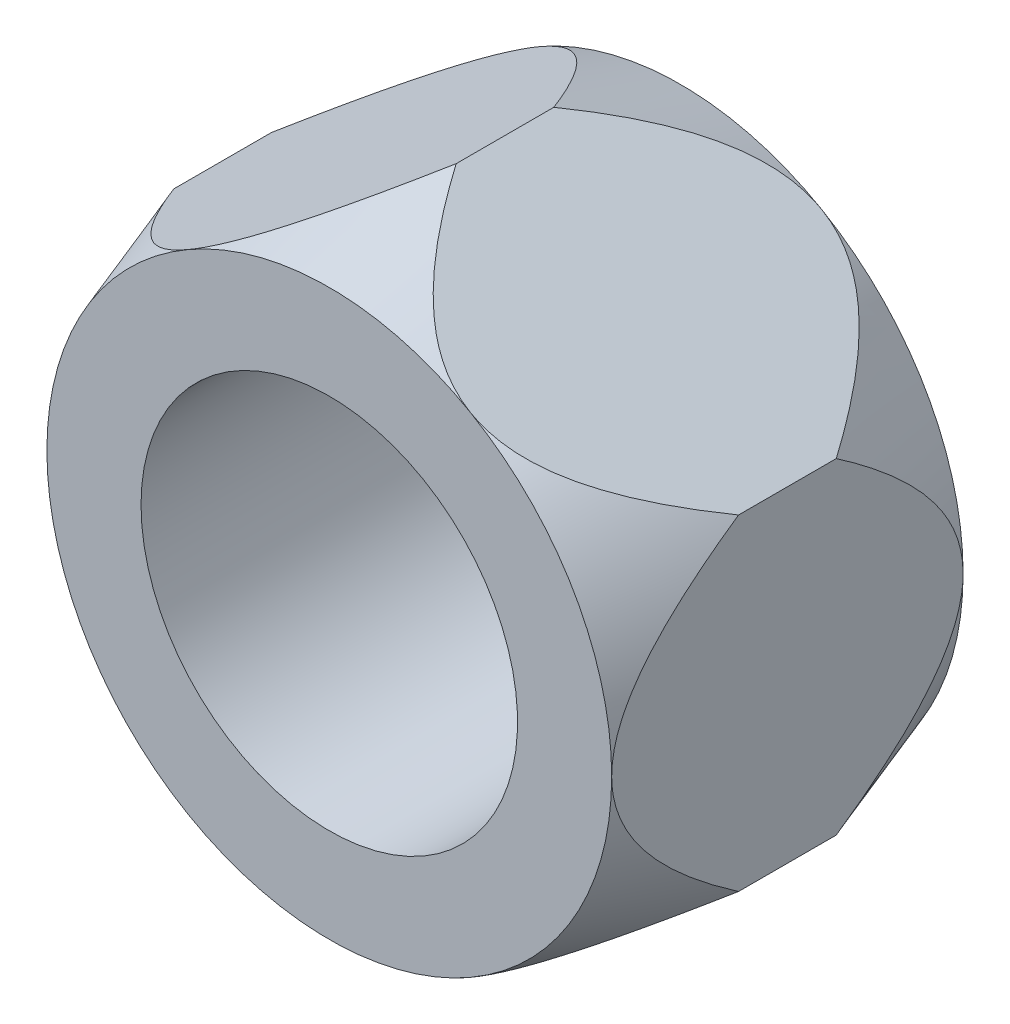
ISO-10303-21;
HEADER;
FILE_DESCRIPTION(('STEP AP214'),'2;1');
FILE_NAME('part.step','',(''),(''),'','','');
FILE_SCHEMA(('AUTOMOTIVE_DESIGN { 1 0 10303 214 1 1 1 1 }'));
ENDSEC;
DATA;
#1=APPLICATION_CONTEXT('core data for automotive mechanical design processes');
#2=APPLICATION_PROTOCOL_DEFINITION('international standard','automotive_design',2000,#1);
#3=PRODUCT_CONTEXT('',#1,'mechanical');
#4=PRODUCT('Part','Part','',(#3));
#5=PRODUCT_RELATED_PRODUCT_CATEGORY('part','',(#4));
#6=PRODUCT_DEFINITION_FORMATION('','',#4);
#7=PRODUCT_DEFINITION_CONTEXT('part definition',#1,'design');
#8=PRODUCT_DEFINITION('design','',#6,#7);
#9=PRODUCT_DEFINITION_SHAPE('','',#8);
#10=(LENGTH_UNIT() NAMED_UNIT(*) SI_UNIT(.MILLI.,.METRE.));
#11=(NAMED_UNIT(*) PLANE_ANGLE_UNIT() SI_UNIT($,.RADIAN.));
#12=(NAMED_UNIT(*) SI_UNIT($,.STERADIAN.) SOLID_ANGLE_UNIT());
#13=UNCERTAINTY_MEASURE_WITH_UNIT(LENGTH_MEASURE(1.E-05),#10,'distance_accuracy_value','');
#14=(GEOMETRIC_REPRESENTATION_CONTEXT(3) GLOBAL_UNCERTAINTY_ASSIGNED_CONTEXT((#13)) GLOBAL_UNIT_ASSIGNED_CONTEXT((#10,
#11,#12)) REPRESENTATION_CONTEXT('',''));
#15=CARTESIAN_POINT('',(0.,0.,0.));
#16=DIRECTION('',(0.,0.,1.));
#17=DIRECTION('',(1.,0.,0.));
#18=AXIS2_PLACEMENT_3D('',#15,#16,#17);
#19=CARTESIAN_POINT('',(2.25,1.29903810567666,2.8));
#20=DIRECTION('',(-0.5,-0.866025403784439,0.));
#21=DIRECTION('',(0.866025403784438,-0.5,0.));
#22=AXIS2_PLACEMENT_3D('',#19,#20,#21);
#23=PLANE('',#22);
#24=CARTESIAN_POINT('',(-0.000199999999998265,2.59819168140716,1.01122209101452));
#25=CARTESIAN_POINT('',(0.0392984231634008,2.5753872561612,0.945103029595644));
#26=CARTESIAN_POINT('',(0.0797896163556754,2.55200965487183,0.879705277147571));
#27=CARTESIAN_POINT('',(0.163716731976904,2.50355431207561,0.750790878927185));
#28=CARTESIAN_POINT('',(0.207170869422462,2.47846605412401,0.687290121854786));
#29=CARTESIAN_POINT('',(0.299429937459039,2.42520025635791,0.560838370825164));
#30=CARTESIAN_POINT('',(0.348385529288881,2.39693573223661,0.498031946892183));
#31=CARTESIAN_POINT('',(0.450998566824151,2.33769206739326,0.377984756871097));
#32=CARTESIAN_POINT('',(0.50464110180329,2.30672153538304,0.320727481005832));
#33=CARTESIAN_POINT('',(0.604897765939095,2.24883832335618,0.227320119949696));
#34=CARTESIAN_POINT('',(0.650228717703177,2.22266648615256,0.189363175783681));
#35=CARTESIAN_POINT('',(0.744846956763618,2.16803862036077,0.121412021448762));
#36=CARTESIAN_POINT('',(0.794100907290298,2.13960183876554,0.0913584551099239));
#37=CARTESIAN_POINT('',(0.883043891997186,2.08825058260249,0.0490012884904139));
#38=CARTESIAN_POINT('',(0.921789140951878,2.06588100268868,0.0341023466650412));
#39=CARTESIAN_POINT('',(1.00090531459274,2.02020325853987,0.0119092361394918));
#40=CARTESIAN_POINT('',(1.04127492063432,1.99689585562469,0.00460902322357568));
#41=CARTESIAN_POINT('',(1.12269142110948,1.94989001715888,-0.00142476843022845));
#42=CARTESIAN_POINT('',(1.16374053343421,1.9261903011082,-0.000119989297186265));
#43=CARTESIAN_POINT('',(1.24497371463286,1.87929030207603,0.010953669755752));
#44=CARTESIAN_POINT('',(1.2851569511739,1.85609049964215,0.0207303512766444));
#45=CARTESIAN_POINT('',(1.37398322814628,1.80480662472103,0.0510489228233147));
#46=CARTESIAN_POINT('',(1.42206139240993,1.77704868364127,0.0737504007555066));
#47=CARTESIAN_POINT('',(1.5145597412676,1.7236447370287,0.127541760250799));
#48=CARTESIAN_POINT('',(1.55896949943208,1.69800475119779,0.1586545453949));
#49=CARTESIAN_POINT('',(1.64169090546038,1.65024552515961,0.224567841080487));
#50=CARTESIAN_POINT('',(1.68020898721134,1.62800710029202,0.259030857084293));
#51=CARTESIAN_POINT('',(1.75460183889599,1.58505636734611,0.331602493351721));
#52=CARTESIAN_POINT('',(1.79047386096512,1.56434564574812,0.369714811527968));
#53=CARTESIAN_POINT('',(1.89496297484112,1.50401882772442,0.48817530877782));
#54=CARTESIAN_POINT('',(1.96022500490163,1.46633977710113,0.572447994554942));
#55=CARTESIAN_POINT('',(2.06282666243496,1.40710268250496,0.716414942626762));
#56=CARTESIAN_POINT('',(2.10198214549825,1.38449625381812,0.774461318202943));
#57=CARTESIAN_POINT('',(2.17775179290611,1.34075062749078,0.891873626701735));
#58=CARTESIAN_POINT('',(2.21438661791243,1.31959950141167,0.951221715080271));
#59=CARTESIAN_POINT('',(2.2502,1.29892263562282,1.01122209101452));
#60=B_SPLINE_CURVE_WITH_KNOTS('',3,(#24,#25,#26,#27,#28,#29,#30,#31,#32,#33,#34,#35,#36,#37,#38,
#39,#40,#41,#42,#43,#44,#45,#46,#47,#48,#49,#50,#51,#52,#53,#54,#55,#56,#57,#58,#59),
.UNSPECIFIED.,.F.,.F.,(4,2,2,2,2,2,2,2,2,2,2,2,2,2,2,2,2,4),(0.,0.241046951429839,
0.483739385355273,0.737008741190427,0.98949981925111,1.18303985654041,1.375081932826,
1.51600574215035,1.65681737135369,1.79825710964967,1.9398272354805,2.11874581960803,
2.29815658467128,2.46670080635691,2.63541766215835,2.97383296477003,3.19452525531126,
3.41311459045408),.UNSPECIFIED.);
#61=CARTESIAN_POINT('',(0.,2.59807621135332,1.01088671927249));
#62=VERTEX_POINT('',#61);
#63=CARTESIAN_POINT('',(1.125,1.94855715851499,0.));
#64=VERTEX_POINT('',#63);
#65=EDGE_CURVE('E48',#62,#64,#60,.T.);
#66=ORIENTED_EDGE('',*,*,#65,.F.);
#67=DIRECTION('',(0.,0.,-1.));
#68=VECTOR('',#67,1.);
#69=CARTESIAN_POINT('',(0.,2.59807621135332,2.8));
#70=LINE('',#69,#68);
#71=CARTESIAN_POINT('',(0.,2.59807621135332,1.78911328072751));
#72=VERTEX_POINT('',#71);
#73=EDGE_CURVE('E165',#72,#62,#70,.T.);
#74=ORIENTED_EDGE('',*,*,#73,.F.);
#75=CARTESIAN_POINT('',(2.2502,1.29892263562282,1.78877790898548));
#76=CARTESIAN_POINT('',(2.2107015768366,1.32172706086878,1.85489697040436));
#77=CARTESIAN_POINT('',(2.17021038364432,1.34510466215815,1.92029472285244));
#78=CARTESIAN_POINT('',(2.08628326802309,1.39356000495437,2.04920912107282));
#79=CARTESIAN_POINT('',(2.04282913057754,1.41864826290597,2.11270987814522));
#80=CARTESIAN_POINT('',(1.95057006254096,1.47191406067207,2.23916162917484));
#81=CARTESIAN_POINT('',(1.90161447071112,1.50017858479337,2.30196805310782));
#82=CARTESIAN_POINT('',(1.79900143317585,1.55942224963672,2.42201524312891));
#83=CARTESIAN_POINT('',(1.74535889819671,1.59039278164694,2.47927251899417));
#84=CARTESIAN_POINT('',(1.6451022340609,1.6482759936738,2.57267988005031));
#85=CARTESIAN_POINT('',(1.59977128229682,1.67444783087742,2.61063682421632));
#86=CARTESIAN_POINT('',(1.50515304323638,1.72907569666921,2.67858797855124));
#87=CARTESIAN_POINT('',(1.4558990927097,1.75751247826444,2.70864154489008));
#88=CARTESIAN_POINT('',(1.36695610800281,1.80886373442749,2.75099871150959));
#89=CARTESIAN_POINT('',(1.32821085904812,1.8312333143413,2.76589765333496));
#90=CARTESIAN_POINT('',(1.24909468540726,1.87691105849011,2.78809076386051));
#91=CARTESIAN_POINT('',(1.20872507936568,1.90021846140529,2.79539097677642));
#92=CARTESIAN_POINT('',(1.12730857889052,1.9472242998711,2.80142476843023));
#93=CARTESIAN_POINT('',(1.08625946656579,1.97092401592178,2.80011998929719));
#94=CARTESIAN_POINT('',(1.00502628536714,2.01782401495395,2.78904633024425));
#95=CARTESIAN_POINT('',(0.964843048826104,2.04102381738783,2.77926964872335));
#96=CARTESIAN_POINT('',(0.876016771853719,2.09230769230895,2.74895107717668));
#97=CARTESIAN_POINT('',(0.827938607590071,2.12006563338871,2.72624959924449));
#98=CARTESIAN_POINT('',(0.735440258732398,2.17346958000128,2.6724582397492));
#99=CARTESIAN_POINT('',(0.691030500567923,2.19910956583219,2.6413454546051));
#100=CARTESIAN_POINT('',(0.608309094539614,2.24686879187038,2.57543215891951));
#101=CARTESIAN_POINT('',(0.569791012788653,2.26910721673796,2.5409691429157));
#102=CARTESIAN_POINT('',(0.49539816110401,2.31205794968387,2.46839750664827));
#103=CARTESIAN_POINT('',(0.459526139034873,2.33276867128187,2.43028518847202));
#104=CARTESIAN_POINT('',(0.355037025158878,2.39309548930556,2.31182469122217));
#105=CARTESIAN_POINT('',(0.289774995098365,2.43077453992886,2.22755200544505));
#106=CARTESIAN_POINT('',(0.187173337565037,2.49001163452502,2.08358505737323));
#107=CARTESIAN_POINT('',(0.148017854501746,2.51261806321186,2.02553868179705));
#108=CARTESIAN_POINT('',(0.0722482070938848,2.5563636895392,1.90812637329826));
#109=CARTESIAN_POINT('',(0.0356133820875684,2.57751481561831,1.84877828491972));
#110=CARTESIAN_POINT('',(-0.000199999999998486,2.59819168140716,1.78877790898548));
#111=B_SPLINE_CURVE_WITH_KNOTS('',3,(#75,#76,#77,#78,#79,#80,#81,#82,#83,#84,#85,#86,#87,#88,
#89,#90,#91,#92,#93,#94,#95,#96,#97,#98,#99,#100,#101,#102,#103,#104,#105,#106,#107,#108,#109,
#110),.UNSPECIFIED.,.F.,.F.,(4,2,2,2,2,2,2,2,2,2,2,2,2,2,2,2,2,4),(0.,0.241046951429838,
0.483739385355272,0.737008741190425,0.989499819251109,1.1830398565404,1.375081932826,
1.51600574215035,1.65681737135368,1.79825710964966,1.93982723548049,2.11874581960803,
2.29815658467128,2.4667008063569,2.63541766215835,2.97383296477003,3.19452525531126,
3.41311459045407),.UNSPECIFIED.);
#112=CARTESIAN_POINT('',(1.125,1.94855715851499,2.8));
#113=VERTEX_POINT('',#112);
#114=EDGE_CURVE('E235',#113,#72,#111,.T.);
#115=ORIENTED_EDGE('',*,*,#114,.F.);
#116=CARTESIAN_POINT('',(2.25,1.29903810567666,1.78911328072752));
#117=VERTEX_POINT('',#116);
#118=EDGE_CURVE('E156',#117,#113,#111,.T.);
#119=ORIENTED_EDGE('',*,*,#118,.F.);
#120=DIRECTION('',(0.,0.,-1.));
#121=VECTOR('',#120,1.);
#122=CARTESIAN_POINT('',(2.25,1.29903810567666,2.8));
#123=LINE('',#122,#121);
#124=CARTESIAN_POINT('',(2.25,1.29903810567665,1.01088671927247));
#125=VERTEX_POINT('',#124);
#126=EDGE_CURVE('E151',#117,#125,#123,.T.);
#127=ORIENTED_EDGE('',*,*,#126,.T.);
#128=EDGE_CURVE('E143',#64,#125,#60,.T.);
#129=ORIENTED_EDGE('',*,*,#128,.F.);
#130=EDGE_LOOP('',(#66,#74,#115,#119,#127,#129));
#131=FACE_BOUND('',#130,.T.);
#132=ADVANCED_FACE('F32',(#131),#23,.F.);
#133=CARTESIAN_POINT('',(0.,2.59807621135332,2.8));
#134=DIRECTION('',(0.5,-0.866025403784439,0.));
#135=DIRECTION('',(0.866025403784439,0.5,0.));
#136=AXIS2_PLACEMENT_3D('',#133,#134,#135);
#137=PLANE('',#136);
#138=CARTESIAN_POINT('',(-2.2502,1.29892263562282,1.01122209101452));
#139=CARTESIAN_POINT('',(-2.2107015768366,1.32172706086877,0.945103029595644));
#140=CARTESIAN_POINT('',(-2.17021038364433,1.34510466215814,0.879705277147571));
#141=CARTESIAN_POINT('',(-2.0862832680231,1.39356000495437,0.750790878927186));
#142=CARTESIAN_POINT('',(-2.04282913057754,1.41864826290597,0.687290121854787));
#143=CARTESIAN_POINT('',(-1.95057006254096,1.47191406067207,0.560838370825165));
#144=CARTESIAN_POINT('',(-1.90161447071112,1.50017858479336,0.498031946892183));
#145=CARTESIAN_POINT('',(-1.79900143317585,1.55942224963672,0.377984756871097));
#146=CARTESIAN_POINT('',(-1.74535889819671,1.59039278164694,0.320727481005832));
#147=CARTESIAN_POINT('',(-1.64510223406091,1.6482759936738,0.227320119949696));
#148=CARTESIAN_POINT('',(-1.59977128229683,1.67444783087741,0.18936317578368));
#149=CARTESIAN_POINT('',(-1.50515304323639,1.72907569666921,0.12141202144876));
#150=CARTESIAN_POINT('',(-1.45589909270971,1.75751247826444,0.0913584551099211));
#151=CARTESIAN_POINT('',(-1.36695610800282,1.80886373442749,0.0490012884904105));
#152=CARTESIAN_POINT('',(-1.32821085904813,1.8312333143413,0.0341023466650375));
#153=CARTESIAN_POINT('',(-1.24909468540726,1.8769110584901,0.0119092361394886));
#154=CARTESIAN_POINT('',(-1.20872507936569,1.90021846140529,0.00460902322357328));
#155=CARTESIAN_POINT('',(-1.12730857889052,1.9472242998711,-0.00142476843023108));
#156=CARTESIAN_POINT('',(-1.08625946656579,1.97092401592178,-0.000119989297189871));
#157=CARTESIAN_POINT('',(-1.00502628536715,2.01782401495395,0.0109536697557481));
#158=CARTESIAN_POINT('',(-0.964843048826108,2.04102381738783,0.0207303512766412));
#159=CARTESIAN_POINT('',(-0.876016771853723,2.09230769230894,0.0510489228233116));
#160=CARTESIAN_POINT('',(-0.827938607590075,2.1200656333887,0.0737504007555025));
#161=CARTESIAN_POINT('',(-0.735440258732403,2.17346958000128,0.127541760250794));
#162=CARTESIAN_POINT('',(-0.691030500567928,2.19910956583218,0.158654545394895));
#163=CARTESIAN_POINT('',(-0.60830909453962,2.24686879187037,0.224567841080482));
#164=CARTESIAN_POINT('',(-0.569791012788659,2.26910721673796,0.259030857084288));
#165=CARTESIAN_POINT('',(-0.495398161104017,2.31205794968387,0.331602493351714));
#166=CARTESIAN_POINT('',(-0.45952613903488,2.33276867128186,0.369714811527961));
#167=CARTESIAN_POINT('',(-0.355037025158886,2.39309548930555,0.488175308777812));
#168=CARTESIAN_POINT('',(-0.289774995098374,2.43077453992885,0.572447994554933));
#169=CARTESIAN_POINT('',(-0.187173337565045,2.49001163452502,0.716414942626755));
#170=CARTESIAN_POINT('',(-0.148017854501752,2.51261806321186,0.774461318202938));
#171=CARTESIAN_POINT('',(-0.0722482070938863,2.55636368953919,0.891873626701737));
#172=CARTESIAN_POINT('',(-0.0356133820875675,2.57751481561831,0.951221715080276));
#173=CARTESIAN_POINT('',(0.000200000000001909,2.59819168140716,1.01122209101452));
#174=B_SPLINE_CURVE_WITH_KNOTS('',3,(#138,#139,#140,#141,#142,#143,#144,#145,#146,#147,#148,
#149,#150,#151,#152,#153,#154,#155,#156,#157,#158,#159,#160,#161,#162,#163,#164,#165,#166,#167,
#168,#169,#170,#171,#172,#173),.UNSPECIFIED.,.F.,.F.,(4,2,2,2,2,2,2,2,2,2,2,2,2,2,2,2,2,4),(0.,
0.241046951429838,0.483739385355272,0.737008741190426,0.98949981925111,1.18303985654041,
1.375081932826,1.51600574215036,1.65681737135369,1.79825710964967,1.9398272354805,
2.11874581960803,2.29815658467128,2.4667008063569,2.63541766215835,2.97383296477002,
3.19452525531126,3.41311459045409),.UNSPECIFIED.);
#175=CARTESIAN_POINT('',(-2.25,1.29903810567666,1.01088671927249));
#176=VERTEX_POINT('',#175);
#177=CARTESIAN_POINT('',(-1.125,1.94855715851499,0.));
#178=VERTEX_POINT('',#177);
#179=EDGE_CURVE('E55',#176,#178,#174,.T.);
#180=ORIENTED_EDGE('',*,*,#179,.F.);
#181=DIRECTION('',(0.,0.,-1.));
#182=VECTOR('',#181,1.);
#183=CARTESIAN_POINT('',(-2.25,1.29903810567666,2.8));
#184=LINE('',#183,#182);
#185=CARTESIAN_POINT('',(-2.25,1.29903810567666,1.78911328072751));
#186=VERTEX_POINT('',#185);
#187=EDGE_CURVE('E162',#186,#176,#184,.T.);
#188=ORIENTED_EDGE('',*,*,#187,.F.);
#189=CARTESIAN_POINT('',(0.000200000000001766,2.59819168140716,1.78877790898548));
#190=CARTESIAN_POINT('',(-0.0392984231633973,2.5753872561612,1.85489697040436));
#191=CARTESIAN_POINT('',(-0.0797896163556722,2.55200965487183,1.92029472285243));
#192=CARTESIAN_POINT('',(-0.163716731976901,2.50355431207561,2.04920912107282));
#193=CARTESIAN_POINT('',(-0.20717086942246,2.47846605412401,2.11270987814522));
#194=CARTESIAN_POINT('',(-0.299429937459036,2.42520025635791,2.23916162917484));
#195=CARTESIAN_POINT('',(-0.348385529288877,2.39693573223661,2.30196805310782));
#196=CARTESIAN_POINT('',(-0.450998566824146,2.33769206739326,2.4220152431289));
#197=CARTESIAN_POINT('',(-0.504641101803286,2.30672153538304,2.47927251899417));
#198=CARTESIAN_POINT('',(-0.604897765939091,2.24883832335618,2.5726798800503));
#199=CARTESIAN_POINT('',(-0.650228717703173,2.22266648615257,2.61063682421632));
#200=CARTESIAN_POINT('',(-0.744846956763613,2.16803862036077,2.67858797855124));
#201=CARTESIAN_POINT('',(-0.794100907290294,2.13960183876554,2.70864154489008));
#202=CARTESIAN_POINT('',(-0.883043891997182,2.08825058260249,2.75099871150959));
#203=CARTESIAN_POINT('',(-0.921789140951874,2.06588100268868,2.76589765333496));
#204=CARTESIAN_POINT('',(-1.00090531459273,2.02020325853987,2.78809076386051));
#205=CARTESIAN_POINT('',(-1.04127492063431,1.99689585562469,2.79539097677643));
#206=CARTESIAN_POINT('',(-1.12269142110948,1.94989001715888,2.80142476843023));
#207=CARTESIAN_POINT('',(-1.16374053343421,1.9261903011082,2.80011998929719));
#208=CARTESIAN_POINT('',(-1.24497371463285,1.87929030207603,2.78904633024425));
#209=CARTESIAN_POINT('',(-1.28515695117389,1.85609049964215,2.77926964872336));
#210=CARTESIAN_POINT('',(-1.37398322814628,1.80480662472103,2.74895107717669));
#211=CARTESIAN_POINT('',(-1.42206139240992,1.77704868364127,2.7262495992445));
#212=CARTESIAN_POINT('',(-1.5145597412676,1.7236447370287,2.67245823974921));
#213=CARTESIAN_POINT('',(-1.55896949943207,1.6980047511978,2.6413454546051));
#214=CARTESIAN_POINT('',(-1.64169090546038,1.65024552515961,2.57543215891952));
#215=CARTESIAN_POINT('',(-1.68020898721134,1.62800710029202,2.54096914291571));
#216=CARTESIAN_POINT('',(-1.75460183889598,1.58505636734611,2.46839750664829));
#217=CARTESIAN_POINT('',(-1.79047386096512,1.56434564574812,2.43028518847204));
#218=CARTESIAN_POINT('',(-1.89496297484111,1.50401882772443,2.31182469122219));
#219=CARTESIAN_POINT('',(-1.96022500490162,1.46633977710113,2.22755200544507));
#220=CARTESIAN_POINT('',(-2.06282666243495,1.40710268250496,2.08358505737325));
#221=CARTESIAN_POINT('',(-2.10198214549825,1.38449625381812,2.02553868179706));
#222=CARTESIAN_POINT('',(-2.17775179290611,1.34075062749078,1.90812637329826));
#223=CARTESIAN_POINT('',(-2.21438661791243,1.31959950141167,1.84877828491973));
#224=CARTESIAN_POINT('',(-2.2502,1.29892263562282,1.78877790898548));
#225=B_SPLINE_CURVE_WITH_KNOTS('',3,(#189,#190,#191,#192,#193,#194,#195,#196,#197,#198,#199,
#200,#201,#202,#203,#204,#205,#206,#207,#208,#209,#210,#211,#212,#213,#214,#215,#216,#217,#218,
#219,#220,#221,#222,#223,#224),.UNSPECIFIED.,.F.,.F.,(4,2,2,2,2,2,2,2,2,2,2,2,2,2,2,2,2,4),(0.,
0.241046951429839,0.483739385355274,0.737008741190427,0.98949981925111,1.18303985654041,
1.375081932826,1.51600574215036,1.65681737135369,1.79825710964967,1.9398272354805,
2.11874581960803,2.29815658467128,2.4667008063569,2.63541766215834,2.97383296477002,
3.19452525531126,3.41311459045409),.UNSPECIFIED.);
#226=CARTESIAN_POINT('',(-1.125,1.94855715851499,2.8));
#227=VERTEX_POINT('',#226);
#228=EDGE_CURVE('E289',#227,#186,#225,.T.);
#229=ORIENTED_EDGE('',*,*,#228,.F.);
#230=EDGE_CURVE('E293',#72,#227,#225,.T.);
#231=ORIENTED_EDGE('',*,*,#230,.F.);
#232=ORIENTED_EDGE('',*,*,#73,.T.);
#233=EDGE_CURVE('E273',#178,#62,#174,.T.);
#234=ORIENTED_EDGE('',*,*,#233,.F.);
#235=EDGE_LOOP('',(#180,#188,#229,#231,#232,#234));
#236=FACE_BOUND('',#235,.T.);
#237=ADVANCED_FACE('F282',(#236),#137,.F.);
#238=CARTESIAN_POINT('',(-2.25,1.29903810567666,2.8));
#239=DIRECTION('',(1.,0.,0.));
#240=DIRECTION('',(0.,0.,-1.));
#241=AXIS2_PLACEMENT_3D('',#238,#239,#240);
#242=PLANE('',#241);
#243=CARTESIAN_POINT('',(-2.25,-4.70370135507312,8.60850169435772));
#244=CARTESIAN_POINT('',(-2.25,-4.59405916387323,8.32130541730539));
#245=CARTESIAN_POINT('',(-2.25,-4.48382865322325,8.03433156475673));
#246=CARTESIAN_POINT('',(-2.25,-4.26179818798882,7.46092738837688));
#247=CARTESIAN_POINT('',(-2.25,-4.14999793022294,7.17449718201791));
#248=CARTESIAN_POINT('',(-2.25,-3.92366920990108,6.60034028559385));
#249=CARTESIAN_POINT('',(-2.25,-3.8091269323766,6.31261902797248));
#250=CARTESIAN_POINT('',(-2.25,-3.57754126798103,5.73823895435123));
#251=CARTESIAN_POINT('',(-2.25,-3.46049829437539,5.45157997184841));
#252=CARTESIAN_POINT('',(-2.25,-3.20797487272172,4.84320266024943));
#253=CARTESIAN_POINT('',(-2.25,-3.0720449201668,4.5216695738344));
#254=CARTESIAN_POINT('',(-2.25,-2.86354991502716,4.04126015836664));
#255=CARTESIAN_POINT('',(-2.25,-2.79326482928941,3.88139477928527));
#256=CARTESIAN_POINT('',(-2.25,-2.65081076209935,3.56250683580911));
#257=CARTESIAN_POINT('',(-2.25,-2.57864181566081,3.40348425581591));
#258=CARTESIAN_POINT('',(-2.25,-2.43222323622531,3.08711303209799));
#259=CARTESIAN_POINT('',(-2.25,-2.35798231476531,2.92976036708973));
#260=CARTESIAN_POINT('',(-2.25,-2.20651702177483,2.616501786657));
#261=CARTESIAN_POINT('',(-2.25,-2.12929283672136,2.46059578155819));
#262=CARTESIAN_POINT('',(-2.25,-1.97097560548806,2.15092312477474));
#263=CARTESIAN_POINT('',(-2.25,-1.88988594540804,1.99715474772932));
#264=CARTESIAN_POINT('',(-2.25,-1.72236581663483,1.69256780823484));
#265=CARTESIAN_POINT('',(-2.25,-1.63593703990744,1.5417483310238));
#266=CARTESIAN_POINT('',(-2.25,-1.52024375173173,1.35152053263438));
#267=CARTESIAN_POINT('',(-2.25,-1.49453895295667,1.30994475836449));
#268=CARTESIAN_POINT('',(-2.25,-1.4424305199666,1.22723134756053));
#269=CARTESIAN_POINT('',(-2.25,-1.41602685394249,1.18609373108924));
#270=CARTESIAN_POINT('',(-2.25,-1.33561312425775,1.06339476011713));
#271=CARTESIAN_POINT('',(-2.25,-1.28042798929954,0.98259321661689));
#272=CARTESIAN_POINT('',(-2.25,-1.16648829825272,0.824538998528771));
#273=CARTESIAN_POINT('',(-2.25,-1.10776698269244,0.747262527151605));
#274=CARTESIAN_POINT('',(-2.25,-0.985097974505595,0.597011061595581));
#275=CARTESIAN_POINT('',(-2.25,-0.921155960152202,0.524031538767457));
#276=CARTESIAN_POINT('',(-2.25,-0.803553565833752,0.402890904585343));
#277=CARTESIAN_POINT('',(-2.25,-0.751500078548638,0.353186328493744));
#278=CARTESIAN_POINT('',(-2.25,-0.642387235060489,0.25941748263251));
#279=CARTESIAN_POINT('',(-2.25,-0.585327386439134,0.215353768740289));
#280=CARTESIAN_POINT('',(-2.25,-0.477036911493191,0.143860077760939));
#281=CARTESIAN_POINT('',(-2.25,-0.426861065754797,0.114862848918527));
#282=CARTESIAN_POINT('',(-2.25,-0.322554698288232,0.0651281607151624));
#283=CARTESIAN_POINT('',(-2.25,-0.2684341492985,0.0443706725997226));
#284=CARTESIAN_POINT('',(-2.25,-0.169398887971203,0.0172943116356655));
#285=CARTESIAN_POINT('',(-2.25,-0.125089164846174,0.00879969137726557));
#286=CARTESIAN_POINT('',(-2.25,-0.035666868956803,-0.000463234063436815));
#287=CARTESIAN_POINT('',(-2.25,0.00944513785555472,-0.00123678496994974));
#288=CARTESIAN_POINT('',(-2.25,0.0990637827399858,0.00503564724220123));
#289=CARTESIAN_POINT('',(-2.25,0.143570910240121,0.0120748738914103));
#290=CARTESIAN_POINT('',(-2.25,0.230888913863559,0.0330947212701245));
#291=CARTESIAN_POINT('',(-2.25,0.273698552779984,0.0470803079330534));
#292=CARTESIAN_POINT('',(-2.25,0.379428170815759,0.0896951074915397));
#293=CARTESIAN_POINT('',(-2.25,0.440783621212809,0.122154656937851));
#294=CARTESIAN_POINT('',(-2.25,0.557987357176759,0.195873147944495));
#295=CARTESIAN_POINT('',(-2.25,0.613813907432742,0.237164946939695));
#296=CARTESIAN_POINT('',(-2.25,0.739086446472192,0.340594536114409));
#297=CARTESIAN_POINT('',(-2.25,0.806613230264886,0.405017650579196));
#298=CARTESIAN_POINT('',(-2.25,0.935333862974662,0.539980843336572));
#299=CARTESIAN_POINT('',(-2.25,0.996513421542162,0.610534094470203));
#300=CARTESIAN_POINT('',(-2.25,1.11480634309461,0.756423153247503));
#301=CARTESIAN_POINT('',(-2.25,1.1718581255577,0.831808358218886));
#302=CARTESIAN_POINT('',(-2.25,1.28214131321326,0.985161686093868));
#303=CARTESIAN_POINT('',(-2.25,1.33537699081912,1.06312677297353));
#304=CARTESIAN_POINT('',(-2.25,1.4477385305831,1.23437693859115));
#305=CARTESIAN_POINT('',(-2.25,1.5063267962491,1.32801284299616));
#306=CARTESIAN_POINT('',(-2.25,1.62044691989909,1.51713702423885));
#307=CARTESIAN_POINT('',(-2.25,1.67597823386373,1.61262562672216));
#308=CARTESIAN_POINT('',(-2.25,1.784653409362,1.80502751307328));
#309=CARTESIAN_POINT('',(-2.25,1.83779571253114,1.90194167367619));
#310=CARTESIAN_POINT('',(-2.25,1.94212109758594,2.09682118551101));
#311=CARTESIAN_POINT('',(-2.25,1.99330407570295,2.19478659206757));
#312=CARTESIAN_POINT('',(-2.25,2.14479771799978,2.490578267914));
#313=CARTESIAN_POINT('',(-2.25,2.24268899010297,2.68964270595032));
#314=CARTESIAN_POINT('',(-2.25,2.43390774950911,3.08983919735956));
#315=CARTESIAN_POINT('',(-2.25,2.52723691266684,3.29097045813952));
#316=CARTESIAN_POINT('',(-2.25,2.6997400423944,3.67097631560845));
#317=CARTESIAN_POINT('',(-2.25,2.77928656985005,3.84968229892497));
#318=CARTESIAN_POINT('',(-2.25,2.93632218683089,4.20801748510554));
#319=CARTESIAN_POINT('',(-2.25,3.01381104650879,4.38764678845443));
#320=CARTESIAN_POINT('',(-2.25,3.1666101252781,4.7463966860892));
#321=CARTESIAN_POINT('',(-2.25,3.24193151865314,4.92551253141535));
#322=CARTESIAN_POINT('',(-2.25,3.39120262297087,5.28428216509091));
#323=CARTESIAN_POINT('',(-2.25,3.46515254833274,5.46393586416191));
#324=CARTESIAN_POINT('',(-2.25,3.53856216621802,5.64380747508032));
#325=B_SPLINE_CURVE_WITH_KNOTS('',3,(#243,#244,#245,#246,#247,#248,#249,#250,#251,#252,#253,
#254,#255,#256,#257,#258,#259,#260,#261,#262,#263,#264,#265,#266,#267,#268,#269,#270,#271,#272,
#273,#274,#275,#276,#277,#278,#279,#280,#281,#282,#283,#284,#285,#286,#287,#288,#289,#290,#291,
#292,#293,#294,#295,#296,#297,#298,#299,#300,#301,#302,#303,#304,#305,#306,#307,#308,#309,#310,
#311,#312,#313,#314,#315,#316,#317,#318,#319,#320,#321,#322,#323,#324),.UNSPECIFIED.,.F.,.F.,(4,
2,2,2,2,2,2,2,2,2,2,2,2,2,2,2,2,2,2,2,2,2,2,2,2,2,2,2,2,2,2,2,2,2,2,2,2,2,2,2,4),(0.,
0.922243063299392,1.84466676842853,2.77370529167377,3.70259145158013,4.74979594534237,
5.27368799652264,5.79757031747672,6.31950926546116,6.84141564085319,7.36287294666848,
7.88416584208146,8.03080055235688,8.1774419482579,8.47088550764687,8.76190574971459,
9.05261357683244,9.26827633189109,9.48396032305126,9.65730124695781,9.83021820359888,
9.96496547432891,10.0996211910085,10.2341605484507,10.3687962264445,10.575829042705,
10.7836458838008,11.0629349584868,11.3428397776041,11.6263029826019,11.9094437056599,
12.2407280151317,12.5720710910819,12.9036272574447,13.2352009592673,13.9006013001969,
14.5657553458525,15.1525706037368,15.7394511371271,16.3223707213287,16.9051983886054),.UNSPECIFIED.);
#326=CARTESIAN_POINT('',(-2.25,-1.29903810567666,1.01088671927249));
#327=VERTEX_POINT('',#326);
#328=CARTESIAN_POINT('',(-2.25,0.,0.));
#329=VERTEX_POINT('',#328);
#330=EDGE_CURVE('E302',#327,#329,#325,.T.);
#331=ORIENTED_EDGE('',*,*,#330,.F.);
#332=DIRECTION('',(0.,0.,-1.));
#333=VECTOR('',#332,1.);
#334=CARTESIAN_POINT('',(-2.25,-1.29903810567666,2.8));
#335=LINE('',#334,#333);
#336=CARTESIAN_POINT('',(-2.25,-1.29903810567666,1.78911328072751));
#337=VERTEX_POINT('',#336);
#338=EDGE_CURVE('E153',#337,#327,#335,.T.);
#339=ORIENTED_EDGE('',*,*,#338,.F.);
#340=CARTESIAN_POINT('',(-2.25,-2.92194312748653,-1.37582513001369));
#341=CARTESIAN_POINT('',(-2.25,-2.86501100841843,-1.24484811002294));
#342=CARTESIAN_POINT('',(-2.25,-2.80757588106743,-1.11408709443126));
#343=CARTESIAN_POINT('',(-2.25,-2.69145941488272,-0.853091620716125));
#344=CARTESIAN_POINT('',(-2.25,-2.63277785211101,-0.722857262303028));
#345=CARTESIAN_POINT('',(-2.25,-2.51346240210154,-0.461993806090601));
#346=CARTESIAN_POINT('',(-2.25,-2.45281646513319,-0.331370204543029));
#347=CARTESIAN_POINT('',(-2.25,-2.32971494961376,-0.0709963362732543));
#348=CARTESIAN_POINT('',(-2.25,-2.26725958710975,0.0587540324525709));
#349=CARTESIAN_POINT('',(-2.25,-2.12905483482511,0.339611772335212));
#350=CARTESIAN_POINT('',(-2.25,-2.05288144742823,0.49051183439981));
#351=CARTESIAN_POINT('',(-2.25,-1.89641670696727,0.790250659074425));
#352=CARTESIAN_POINT('',(-2.25,-1.81612364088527,0.939088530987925));
#353=CARTESIAN_POINT('',(-2.25,-1.65027661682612,1.2330399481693));
#354=CARTESIAN_POINT('',(-2.25,-1.56474601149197,1.37816644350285));
#355=CARTESIAN_POINT('',(-2.25,-1.43043152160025,1.59201312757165));
#356=CARTESIAN_POINT('',(-2.25,-1.38467428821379,1.66263038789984));
#357=CARTESIAN_POINT('',(-2.25,-1.29065700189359,1.80217200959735));
#358=CARTESIAN_POINT('',(-2.25,-1.24239741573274,1.87109668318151));
#359=CARTESIAN_POINT('',(-2.25,-1.14394920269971,2.00499563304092));
#360=CARTESIAN_POINT('',(-2.25,-1.09383641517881,2.07002526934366));
#361=CARTESIAN_POINT('',(-2.25,-0.989710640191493,2.19709206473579));
#362=CARTESIAN_POINT('',(-2.25,-0.935691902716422,2.25912457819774));
#363=CARTESIAN_POINT('',(-2.25,-0.823873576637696,2.37732481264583));
#364=CARTESIAN_POINT('',(-2.25,-0.766175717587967,2.43358752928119));
#365=CARTESIAN_POINT('',(-2.25,-0.644756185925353,2.5390804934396));
#366=CARTESIAN_POINT('',(-2.25,-0.581053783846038,2.58833204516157));
#367=CARTESIAN_POINT('',(-2.25,-0.468577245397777,2.66101339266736));
#368=CARTESIAN_POINT('',(-2.25,-0.421866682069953,2.68758775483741));
#369=CARTESIAN_POINT('',(-2.25,-0.325035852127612,2.73361828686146));
#370=CARTESIAN_POINT('',(-2.25,-0.274921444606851,2.7530863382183));
#371=CARTESIAN_POINT('',(-2.25,-0.180125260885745,2.78028667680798));
#372=CARTESIAN_POINT('',(-2.25,-0.135845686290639,2.7893922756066));
#373=CARTESIAN_POINT('',(-2.25,-0.0463485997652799,2.79990049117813));
#374=CARTESIAN_POINT('',(-2.25,-0.00113112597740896,2.80130342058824));
#375=CARTESIAN_POINT('',(-2.25,0.0888196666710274,2.79621555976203));
#376=CARTESIAN_POINT('',(-2.25,0.133553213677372,2.78972866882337));
#377=CARTESIAN_POINT('',(-2.25,0.221364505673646,2.76968618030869));
#378=CARTESIAN_POINT('',(-2.25,0.264441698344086,2.75612824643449));
#379=CARTESIAN_POINT('',(-2.25,0.369630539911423,2.71491632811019));
#380=CARTESIAN_POINT('',(-2.25,0.430287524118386,2.68360026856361));
#381=CARTESIAN_POINT('',(-2.25,0.54625046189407,2.61221400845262));
#382=CARTESIAN_POINT('',(-2.25,0.601534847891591,2.57211047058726));
#383=CARTESIAN_POINT('',(-2.25,0.724325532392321,2.47251752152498));
#384=CARTESIAN_POINT('',(-2.25,0.790097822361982,2.4109268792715));
#385=CARTESIAN_POINT('',(-2.25,0.915566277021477,2.28176858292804));
#386=CARTESIAN_POINT('',(-2.25,0.97524909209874,2.21418837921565));
#387=CARTESIAN_POINT('',(-2.25,1.09068380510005,2.07434743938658));
#388=CARTESIAN_POINT('',(-2.25,1.14637643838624,2.00203831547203));
#389=CARTESIAN_POINT('',(-2.25,1.25404565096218,1.85485825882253));
#390=CARTESIAN_POINT('',(-2.25,1.30602628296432,1.77999025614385));
#391=CARTESIAN_POINT('',(-2.25,1.4155268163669,1.61579159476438));
#392=CARTESIAN_POINT('',(-2.25,1.47253544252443,1.52612179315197));
#393=CARTESIAN_POINT('',(-2.25,1.58356665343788,1.34494502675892));
#394=CARTESIAN_POINT('',(-2.25,1.63758869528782,1.25343773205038));
#395=CARTESIAN_POINT('',(-2.25,1.79620286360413,0.976785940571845));
#396=CARTESIAN_POINT('',(-2.25,1.8972699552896,0.789625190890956));
#397=CARTESIAN_POINT('',(-2.25,2.09350659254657,0.411443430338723));
#398=CARTESIAN_POINT('',(-2.25,2.18865379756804,0.220411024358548));
#399=CARTESIAN_POINT('',(-2.25,2.3744281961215,-0.163742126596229));
#400=CARTESIAN_POINT('',(-2.25,2.46505709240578,-0.356862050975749));
#401=CARTESIAN_POINT('',(-2.25,2.63249985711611,-0.721762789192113));
#402=CARTESIAN_POINT('',(-2.25,2.70968280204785,-0.893375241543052));
#403=CARTESIAN_POINT('',(-2.25,2.862005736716,-1.23752648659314));
#404=CARTESIAN_POINT('',(-2.25,2.93714549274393,-1.41006538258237));
#405=CARTESIAN_POINT('',(-2.25,3.08525420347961,-1.75464488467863));
#406=CARTESIAN_POINT('',(-2.25,3.15823464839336,-1.92668056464));
#407=CARTESIAN_POINT('',(-2.25,3.30282958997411,-2.27129244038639));
#408=CARTESIAN_POINT('',(-2.25,3.37444430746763,-2.44386854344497));
#409=CARTESIAN_POINT('',(-2.25,3.44551961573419,-2.61666396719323));
#410=B_SPLINE_CURVE_WITH_KNOTS('',3,(#340,#341,#342,#343,#344,#345,#346,#347,#348,#349,#350,
#351,#352,#353,#354,#355,#356,#357,#358,#359,#360,#361,#362,#363,#364,#365,#366,#367,#368,#369,
#370,#371,#372,#373,#374,#375,#376,#377,#378,#379,#380,#381,#382,#383,#384,#385,#386,#387,#388,
#389,#390,#391,#392,#393,#394,#395,#396,#397,#398,#399,#400,#401,#402,#403,#404,#405,#406,#407,
#408,#409),.UNSPECIFIED.,.F.,.F.,(4,2,2,2,2,2,2,2,2,2,2,2,2,2,2,2,2,2,2,2,2,2,2,2,2,2,2,2,2,2,2,
2,2,2,4),(0.,0.428448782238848,0.856975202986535,1.28900966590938,1.72099275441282,
2.22805194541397,2.73532371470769,3.24047857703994,3.49287635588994,3.74522722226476,
3.99141843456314,4.23797975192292,4.4794241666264,4.72011850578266,4.88091794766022,
5.0414472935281,5.17646703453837,5.31148129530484,5.44642885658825,5.58142103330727,
5.78503012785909,5.98942546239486,6.25908497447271,6.52932348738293,6.80297991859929,
7.07633285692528,7.39502540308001,7.71377569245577,8.35168107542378,8.9918636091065,
9.63180303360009,10.1962989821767,10.7608592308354,11.3214794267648,11.8820081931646),.UNSPECIFIED.);
#411=CARTESIAN_POINT('',(-2.25,0.,2.8));
#412=VERTEX_POINT('',#411);
#413=EDGE_CURVE('E201',#412,#337,#410,.F.);
#414=ORIENTED_EDGE('',*,*,#413,.F.);
#415=EDGE_CURVE('E294',#186,#412,#410,.F.);
#416=ORIENTED_EDGE('',*,*,#415,.F.);
#417=ORIENTED_EDGE('',*,*,#187,.T.);
#418=EDGE_CURVE('E278',#329,#176,#325,.T.);
#419=ORIENTED_EDGE('',*,*,#418,.F.);
#420=EDGE_LOOP('',(#331,#339,#414,#416,#417,#419));
#421=FACE_BOUND('',#420,.T.);
#422=ADVANCED_FACE('F285',(#421),#242,.F.);
#423=CARTESIAN_POINT('',(-2.25,-1.29903810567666,2.8));
#424=DIRECTION('',(0.500000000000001,0.866025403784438,0.));
#425=DIRECTION('',(-0.866025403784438,0.500000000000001,0.));
#426=AXIS2_PLACEMENT_3D('',#423,#424,#425);
#427=PLANE('',#426);
#428=CARTESIAN_POINT('',(0.000199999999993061,-2.59819168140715,1.01122209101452));
#429=CARTESIAN_POINT('',(-0.039298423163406,-2.5753872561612,0.945103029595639));
#430=CARTESIAN_POINT('',(-0.0797896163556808,-2.55200965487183,0.879705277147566));
#431=CARTESIAN_POINT('',(-0.163716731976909,-2.50355431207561,0.750790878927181));
#432=CARTESIAN_POINT('',(-0.207170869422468,-2.47846605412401,0.687290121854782));
#433=CARTESIAN_POINT('',(-0.299429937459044,-2.42520025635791,0.56083837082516));
#434=CARTESIAN_POINT('',(-0.348385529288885,-2.39693573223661,0.498031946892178));
#435=CARTESIAN_POINT('',(-0.450998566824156,-2.33769206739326,0.377984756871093));
#436=CARTESIAN_POINT('',(-0.504641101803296,-2.30672153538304,0.320727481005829));
#437=CARTESIAN_POINT('',(-0.604897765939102,-2.24883832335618,0.227320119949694));
#438=CARTESIAN_POINT('',(-0.650228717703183,-2.22266648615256,0.189363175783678));
#439=CARTESIAN_POINT('',(-0.744846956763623,-2.16803862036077,0.121412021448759));
#440=CARTESIAN_POINT('',(-0.794100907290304,-2.13960183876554,0.0913584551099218));
#441=CARTESIAN_POINT('',(-0.883043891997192,-2.08825058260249,0.0490012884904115));
#442=CARTESIAN_POINT('',(-0.921789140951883,-2.06588100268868,0.0341023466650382));
#443=CARTESIAN_POINT('',(-1.00090531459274,-2.02020325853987,0.0119092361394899));
#444=CARTESIAN_POINT('',(-1.04127492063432,-1.99689585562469,0.00460902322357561));
#445=CARTESIAN_POINT('',(-1.12269142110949,-1.94989001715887,-0.00142476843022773));
#446=CARTESIAN_POINT('',(-1.16374053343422,-1.92619030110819,-0.000119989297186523));
#447=CARTESIAN_POINT('',(-1.24497371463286,-1.87929030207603,0.0109536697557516));
#448=CARTESIAN_POINT('',(-1.2851569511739,-1.85609049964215,0.0207303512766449));
#449=CARTESIAN_POINT('',(-1.37398322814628,-1.80480662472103,0.051048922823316));
#450=CARTESIAN_POINT('',(-1.42206139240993,-1.77704868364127,0.0737504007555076));
#451=CARTESIAN_POINT('',(-1.51455974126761,-1.7236447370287,0.127541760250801));
#452=CARTESIAN_POINT('',(-1.55896949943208,-1.69800475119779,0.158654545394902));
#453=CARTESIAN_POINT('',(-1.64169090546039,-1.6502455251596,0.224567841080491));
#454=CARTESIAN_POINT('',(-1.68020898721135,-1.62800710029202,0.259030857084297));
#455=CARTESIAN_POINT('',(-1.75460183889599,-1.5850563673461,0.331602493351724));
#456=CARTESIAN_POINT('',(-1.79047386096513,-1.56434564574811,0.369714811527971));
#457=CARTESIAN_POINT('',(-1.89496297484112,-1.50401882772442,0.488175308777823));
#458=CARTESIAN_POINT('',(-1.96022500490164,-1.46633977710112,0.572447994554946));
#459=CARTESIAN_POINT('',(-2.06282666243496,-1.40710268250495,0.716414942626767));
#460=CARTESIAN_POINT('',(-2.10198214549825,-1.38449625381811,0.774461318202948));
#461=CARTESIAN_POINT('',(-2.17775179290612,-1.34075062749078,0.891873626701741));
#462=CARTESIAN_POINT('',(-2.21438661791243,-1.31959950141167,0.951221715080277));
#463=CARTESIAN_POINT('',(-2.2502,-1.29892263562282,1.01122209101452));
#464=B_SPLINE_CURVE_WITH_KNOTS('',3,(#428,#429,#430,#431,#432,#433,#434,#435,#436,#437,#438,
#439,#440,#441,#442,#443,#444,#445,#446,#447,#448,#449,#450,#451,#452,#453,#454,#455,#456,#457,
#458,#459,#460,#461,#462,#463),.UNSPECIFIED.,.F.,.F.,(4,2,2,2,2,2,2,2,2,2,2,2,2,2,2,2,2,4),(0.,
0.241046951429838,0.483739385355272,0.737008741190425,0.989499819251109,1.18303985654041,
1.375081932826,1.51600574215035,1.65681737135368,1.79825710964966,1.93982723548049,
2.11874581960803,2.29815658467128,2.4667008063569,2.63541766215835,2.97383296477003,
3.19452525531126,3.41311459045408),.UNSPECIFIED.);
#465=CARTESIAN_POINT('',(0.,-2.59807621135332,1.01088671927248));
#466=VERTEX_POINT('',#465);
#467=CARTESIAN_POINT('',(-1.125,-1.94855715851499,0.));
#468=VERTEX_POINT('',#467);
#469=EDGE_CURVE('E268',#466,#468,#464,.T.);
#470=ORIENTED_EDGE('',*,*,#469,.F.);
#471=DIRECTION('',(0.,0.,-1.));
#472=VECTOR('',#471,1.);
#473=CARTESIAN_POINT('',(0.,-2.59807621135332,2.8));
#474=LINE('',#473,#472);
#475=CARTESIAN_POINT('',(0.,-2.59807621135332,1.78911328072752));
#476=VERTEX_POINT('',#475);
#477=EDGE_CURVE('E150',#476,#466,#474,.T.);
#478=ORIENTED_EDGE('',*,*,#477,.F.);
#479=CARTESIAN_POINT('',(-2.2502,-1.29892263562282,1.78877790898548));
#480=CARTESIAN_POINT('',(-2.2107015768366,-1.32172706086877,1.85489697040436));
#481=CARTESIAN_POINT('',(-2.17021038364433,-1.34510466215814,1.92029472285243));
#482=CARTESIAN_POINT('',(-2.0862832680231,-1.39356000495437,2.04920912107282));
#483=CARTESIAN_POINT('',(-2.04282913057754,-1.41864826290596,2.11270987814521));
#484=CARTESIAN_POINT('',(-1.95057006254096,-1.47191406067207,2.23916162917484));
#485=CARTESIAN_POINT('',(-1.90161447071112,-1.50017858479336,2.30196805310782));
#486=CARTESIAN_POINT('',(-1.79900143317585,-1.55942224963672,2.4220152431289));
#487=CARTESIAN_POINT('',(-1.74535889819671,-1.59039278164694,2.47927251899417));
#488=CARTESIAN_POINT('',(-1.64510223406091,-1.6482759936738,2.5726798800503));
#489=CARTESIAN_POINT('',(-1.59977128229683,-1.67444783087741,2.61063682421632));
#490=CARTESIAN_POINT('',(-1.50515304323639,-1.72907569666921,2.67858797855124));
#491=CARTESIAN_POINT('',(-1.45589909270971,-1.75751247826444,2.70864154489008));
#492=CARTESIAN_POINT('',(-1.36695610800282,-1.80886373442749,2.75099871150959));
#493=CARTESIAN_POINT('',(-1.32821085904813,-1.8312333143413,2.76589765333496));
#494=CARTESIAN_POINT('',(-1.24909468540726,-1.8769110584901,2.78809076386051));
#495=CARTESIAN_POINT('',(-1.20872507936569,-1.90021846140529,2.79539097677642));
#496=CARTESIAN_POINT('',(-1.12730857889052,-1.9472242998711,2.80142476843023));
#497=CARTESIAN_POINT('',(-1.08625946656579,-1.97092401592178,2.80011998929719));
#498=CARTESIAN_POINT('',(-1.00502628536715,-2.01782401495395,2.78904633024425));
#499=CARTESIAN_POINT('',(-0.964843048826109,-2.04102381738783,2.77926964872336));
#500=CARTESIAN_POINT('',(-0.876016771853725,-2.09230769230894,2.74895107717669));
#501=CARTESIAN_POINT('',(-0.827938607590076,-2.1200656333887,2.72624959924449));
#502=CARTESIAN_POINT('',(-0.735440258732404,-2.17346958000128,2.6724582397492));
#503=CARTESIAN_POINT('',(-0.69103050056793,-2.19910956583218,2.6413454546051));
#504=CARTESIAN_POINT('',(-0.608309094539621,-2.24686879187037,2.57543215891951));
#505=CARTESIAN_POINT('',(-0.56979101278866,-2.26910721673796,2.54096914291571));
#506=CARTESIAN_POINT('',(-0.495398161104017,-2.31205794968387,2.46839750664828));
#507=CARTESIAN_POINT('',(-0.45952613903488,-2.33276867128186,2.43028518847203));
#508=CARTESIAN_POINT('',(-0.355037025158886,-2.39309548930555,2.31182469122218));
#509=CARTESIAN_POINT('',(-0.289774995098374,-2.43077453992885,2.22755200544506));
#510=CARTESIAN_POINT('',(-0.187173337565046,-2.49001163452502,2.08358505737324));
#511=CARTESIAN_POINT('',(-0.148017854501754,-2.51261806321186,2.02553868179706));
#512=CARTESIAN_POINT('',(-0.0722482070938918,-2.55636368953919,1.90812637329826));
#513=CARTESIAN_POINT('',(-0.0356133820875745,-2.57751481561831,1.84877828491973));
#514=CARTESIAN_POINT('',(0.000199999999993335,-2.59819168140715,1.78877790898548));
#515=B_SPLINE_CURVE_WITH_KNOTS('',3,(#479,#480,#481,#482,#483,#484,#485,#486,#487,#488,#489,
#490,#491,#492,#493,#494,#495,#496,#497,#498,#499,#500,#501,#502,#503,#504,#505,#506,#507,#508,
#509,#510,#511,#512,#513,#514),.UNSPECIFIED.,.F.,.F.,(4,2,2,2,2,2,2,2,2,2,2,2,2,2,2,2,2,4),(0.,
0.241046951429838,0.483739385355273,0.737008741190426,0.989499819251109,1.18303985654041,
1.375081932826,1.51600574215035,1.65681737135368,1.79825710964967,1.9398272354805,
2.11874581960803,2.29815658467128,2.4667008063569,2.63541766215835,2.97383296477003,
3.19452525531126,3.41311459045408),.UNSPECIFIED.);
#516=CARTESIAN_POINT('',(-1.125,-1.94855715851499,2.8));
#517=VERTEX_POINT('',#516);
#518=EDGE_CURVE('E192',#517,#476,#515,.T.);
#519=ORIENTED_EDGE('',*,*,#518,.F.);
#520=EDGE_CURVE('E195',#337,#517,#515,.T.);
#521=ORIENTED_EDGE('',*,*,#520,.F.);
#522=ORIENTED_EDGE('',*,*,#338,.T.);
#523=EDGE_CURVE('E274',#468,#327,#464,.T.);
#524=ORIENTED_EDGE('',*,*,#523,.F.);
#525=EDGE_LOOP('',(#470,#478,#519,#521,#522,#524));
#526=FACE_BOUND('',#525,.T.);
#527=ADVANCED_FACE('F194',(#526),#427,.F.);
#528=CARTESIAN_POINT('',(0.,-2.59807621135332,2.8));
#529=DIRECTION('',(-0.5,0.866025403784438,0.));
#530=DIRECTION('',(-0.866025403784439,-0.5,0.));
#531=AXIS2_PLACEMENT_3D('',#528,#529,#530);
#532=PLANE('',#531);
#533=CARTESIAN_POINT('',(2.2502,-1.29892263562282,1.01122209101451));
#534=CARTESIAN_POINT('',(2.2107015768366,-1.32172706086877,0.945103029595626));
#535=CARTESIAN_POINT('',(2.17021038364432,-1.34510466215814,0.879705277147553));
#536=CARTESIAN_POINT('',(2.0862832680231,-1.39356000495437,0.750790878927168));
#537=CARTESIAN_POINT('',(2.04282913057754,-1.41864826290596,0.687290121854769));
#538=CARTESIAN_POINT('',(1.95057006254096,-1.47191406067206,0.560838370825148));
#539=CARTESIAN_POINT('',(1.90161447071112,-1.50017858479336,0.498031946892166));
#540=CARTESIAN_POINT('',(1.79900143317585,-1.55942224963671,0.377984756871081));
#541=CARTESIAN_POINT('',(1.74535889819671,-1.59039278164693,0.320727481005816));
#542=CARTESIAN_POINT('',(1.6451022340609,-1.64827599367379,0.22732011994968));
#543=CARTESIAN_POINT('',(1.59977128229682,-1.67444783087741,0.189363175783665));
#544=CARTESIAN_POINT('',(1.50515304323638,-1.7290756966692,0.121412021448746));
#545=CARTESIAN_POINT('',(1.4558990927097,-1.75751247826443,0.0913584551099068));
#546=CARTESIAN_POINT('',(1.36695610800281,-1.80886373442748,0.0490012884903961));
#547=CARTESIAN_POINT('',(1.32821085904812,-1.83123331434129,0.034102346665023));
#548=CARTESIAN_POINT('',(1.24909468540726,-1.8769110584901,0.0119092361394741));
#549=CARTESIAN_POINT('',(1.20872507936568,-1.90021846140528,0.00460902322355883));
#550=CARTESIAN_POINT('',(1.12730857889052,-1.94722429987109,-0.0014247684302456));
#551=CARTESIAN_POINT('',(1.08625946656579,-1.97092401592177,-0.00011998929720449));
#552=CARTESIAN_POINT('',(1.00502628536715,-2.01782401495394,0.010953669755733));
#553=CARTESIAN_POINT('',(0.964843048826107,-2.04102381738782,0.0207303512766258));
#554=CARTESIAN_POINT('',(0.876016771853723,-2.09230769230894,0.0510489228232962));
#555=CARTESIAN_POINT('',(0.827938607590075,-2.1200656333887,0.0737504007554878));
#556=CARTESIAN_POINT('',(0.735440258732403,-2.17346958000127,0.12754176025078));
#557=CARTESIAN_POINT('',(0.691030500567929,-2.19910956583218,0.158654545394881));
#558=CARTESIAN_POINT('',(0.608309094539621,-2.24686879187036,0.224567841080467));
#559=CARTESIAN_POINT('',(0.56979101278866,-2.26910721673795,0.259030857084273));
#560=CARTESIAN_POINT('',(0.495398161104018,-2.31205794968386,0.331602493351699));
#561=CARTESIAN_POINT('',(0.459526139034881,-2.33276867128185,0.369714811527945));
#562=CARTESIAN_POINT('',(0.355037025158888,-2.39309548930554,0.488175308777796));
#563=CARTESIAN_POINT('',(0.289774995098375,-2.43077453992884,0.572447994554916));
#564=CARTESIAN_POINT('',(0.187173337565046,-2.49001163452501,0.71641494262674));
#565=CARTESIAN_POINT('',(0.148017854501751,-2.51261806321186,0.774461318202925));
#566=CARTESIAN_POINT('',(0.0722482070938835,-2.55636368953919,0.891873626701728));
#567=CARTESIAN_POINT('',(0.0356133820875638,-2.5775148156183,0.951221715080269));
#568=CARTESIAN_POINT('',(-0.00020000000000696,-2.59819168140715,1.01122209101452));
#569=B_SPLINE_CURVE_WITH_KNOTS('',3,(#533,#534,#535,#536,#537,#538,#539,#540,#541,#542,#543,
#544,#545,#546,#547,#548,#549,#550,#551,#552,#553,#554,#555,#556,#557,#558,#559,#560,#561,#562,
#563,#564,#565,#566,#567,#568),.UNSPECIFIED.,.F.,.F.,(4,2,2,2,2,2,2,2,2,2,2,2,2,2,2,2,2,4),(0.,
0.241046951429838,0.483739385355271,0.737008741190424,0.989499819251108,1.1830398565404,
1.375081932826,1.51600574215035,1.65681737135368,1.79825710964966,1.93982723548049,
2.11874581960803,2.29815658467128,2.4667008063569,2.63541766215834,2.97383296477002,
3.19452525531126,3.4131145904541),.UNSPECIFIED.);
#570=CARTESIAN_POINT('',(2.25,-1.29903810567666,1.01088671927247));
#571=VERTEX_POINT('',#570);
#572=CARTESIAN_POINT('',(1.125,-1.94855715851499,0.));
#573=VERTEX_POINT('',#572);
#574=EDGE_CURVE('E126',#571,#573,#569,.T.);
#575=ORIENTED_EDGE('',*,*,#574,.F.);
#576=DIRECTION('',(0.,0.,-1.));
#577=VECTOR('',#576,1.);
#578=CARTESIAN_POINT('',(2.25,-1.29903810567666,2.8));
#579=LINE('',#578,#577);
#580=CARTESIAN_POINT('',(2.25,-1.29903810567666,1.78911328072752));
#581=VERTEX_POINT('',#580);
#582=EDGE_CURVE('E140',#581,#571,#579,.T.);
#583=ORIENTED_EDGE('',*,*,#582,.F.);
#584=CARTESIAN_POINT('',(-0.00020000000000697,-2.59819168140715,1.78877790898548));
#585=CARTESIAN_POINT('',(0.0392984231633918,-2.5753872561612,1.85489697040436));
#586=CARTESIAN_POINT('',(0.0797896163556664,-2.55200965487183,1.92029472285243));
#587=CARTESIAN_POINT('',(0.163716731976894,-2.50355431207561,2.04920912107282));
#588=CARTESIAN_POINT('',(0.207170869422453,-2.47846605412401,2.11270987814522));
#589=CARTESIAN_POINT('',(0.299429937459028,-2.42520025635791,2.23916162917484));
#590=CARTESIAN_POINT('',(0.348385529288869,-2.39693573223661,2.30196805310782));
#591=CARTESIAN_POINT('',(0.450998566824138,-2.33769206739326,2.42201524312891));
#592=CARTESIAN_POINT('',(0.504641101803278,-2.30672153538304,2.47927251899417));
#593=CARTESIAN_POINT('',(0.604897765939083,-2.24883832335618,2.57267988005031));
#594=CARTESIAN_POINT('',(0.650228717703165,-2.22266648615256,2.61063682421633));
#595=CARTESIAN_POINT('',(0.744846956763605,-2.16803862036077,2.67858797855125));
#596=CARTESIAN_POINT('',(0.794100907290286,-2.13960183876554,2.70864154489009));
#597=CARTESIAN_POINT('',(0.883043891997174,-2.08825058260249,2.7509987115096));
#598=CARTESIAN_POINT('',(0.921789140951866,-2.06588100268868,2.76589765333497));
#599=CARTESIAN_POINT('',(1.00090531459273,-2.02020325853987,2.78809076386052));
#600=CARTESIAN_POINT('',(1.04127492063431,-1.99689585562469,2.79539097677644));
#601=CARTESIAN_POINT('',(1.12269142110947,-1.94989001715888,2.80142476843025));
#602=CARTESIAN_POINT('',(1.1637405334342,-1.9261903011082,2.8001199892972));
#603=CARTESIAN_POINT('',(1.24497371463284,-1.87929030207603,2.78904633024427));
#604=CARTESIAN_POINT('',(1.28515695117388,-1.85609049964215,2.77926964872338));
#605=CARTESIAN_POINT('',(1.37398322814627,-1.80480662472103,2.74895107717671));
#606=CARTESIAN_POINT('',(1.42206139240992,-1.77704868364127,2.72624959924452));
#607=CARTESIAN_POINT('',(1.51455974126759,-1.7236447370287,2.67245823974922));
#608=CARTESIAN_POINT('',(1.55896949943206,-1.69800475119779,2.64134545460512));
#609=CARTESIAN_POINT('',(1.64169090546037,-1.65024552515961,2.57543215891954));
#610=CARTESIAN_POINT('',(1.68020898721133,-1.62800710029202,2.54096914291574));
#611=CARTESIAN_POINT('',(1.75460183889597,-1.58505636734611,2.46839750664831));
#612=CARTESIAN_POINT('',(1.79047386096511,-1.56434564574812,2.43028518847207));
#613=CARTESIAN_POINT('',(1.8949629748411,-1.50401882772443,2.31182469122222));
#614=CARTESIAN_POINT('',(1.96022500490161,-1.46633977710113,2.2275520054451));
#615=CARTESIAN_POINT('',(2.06282666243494,-1.40710268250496,2.08358505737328));
#616=CARTESIAN_POINT('',(2.10198214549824,-1.38449625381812,2.02553868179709));
#617=CARTESIAN_POINT('',(2.17775179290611,-1.34075062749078,1.90812637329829));
#618=CARTESIAN_POINT('',(2.21438661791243,-1.31959950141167,1.84877828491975));
#619=CARTESIAN_POINT('',(2.2502,-1.29892263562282,1.78877790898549));
#620=B_SPLINE_CURVE_WITH_KNOTS('',3,(#584,#585,#586,#587,#588,#589,#590,#591,#592,#593,#594,
#595,#596,#597,#598,#599,#600,#601,#602,#603,#604,#605,#606,#607,#608,#609,#610,#611,#612,#613,
#614,#615,#616,#617,#618,#619),.UNSPECIFIED.,.F.,.F.,(4,2,2,2,2,2,2,2,2,2,2,2,2,2,2,2,2,4),(0.,
0.241046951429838,0.483739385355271,0.737008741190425,0.989499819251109,1.18303985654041,
1.375081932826,1.51600574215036,1.65681737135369,1.79825710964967,1.9398272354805,
2.11874581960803,2.29815658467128,2.4667008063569,2.63541766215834,2.97383296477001,
3.19452525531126,3.4131145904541),.UNSPECIFIED.);
#621=CARTESIAN_POINT('',(1.125,-1.94855715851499,2.8));
#622=VERTEX_POINT('',#621);
#623=EDGE_CURVE('E202',#622,#581,#620,.T.);
#624=ORIENTED_EDGE('',*,*,#623,.F.);
#625=EDGE_CURVE('E199',#476,#622,#620,.T.);
#626=ORIENTED_EDGE('',*,*,#625,.F.);
#627=ORIENTED_EDGE('',*,*,#477,.T.);
#628=EDGE_CURVE('E142',#573,#466,#569,.T.);
#629=ORIENTED_EDGE('',*,*,#628,.F.);
#630=EDGE_LOOP('',(#575,#583,#624,#626,#627,#629));
#631=FACE_BOUND('',#630,.T.);
#632=ADVANCED_FACE('F138',(#631),#532,.F.);
#633=CARTESIAN_POINT('',(2.25,-1.29903810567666,2.8));
#634=DIRECTION('',(-1.,0.,0.));
#635=DIRECTION('',(0.,0.,1.));
#636=AXIS2_PLACEMENT_3D('',#633,#634,#635);
#637=PLANE('',#636);
#638=CARTESIAN_POINT('',(2.25,-4.70370135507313,8.60850169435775));
#639=CARTESIAN_POINT('',(2.25,-4.59405916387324,8.32130541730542));
#640=CARTESIAN_POINT('',(2.25,-4.48382865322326,8.03433156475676));
#641=CARTESIAN_POINT('',(2.25,-4.26179818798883,7.4609273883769));
#642=CARTESIAN_POINT('',(2.25,-4.14999793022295,7.17449718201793));
#643=CARTESIAN_POINT('',(2.25,-3.92366920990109,6.60034028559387));
#644=CARTESIAN_POINT('',(2.25,-3.80912693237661,6.3126190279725));
#645=CARTESIAN_POINT('',(2.25,-3.57754126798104,5.73823895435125));
#646=CARTESIAN_POINT('',(2.25,-3.46049829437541,5.45157997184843));
#647=CARTESIAN_POINT('',(2.25,-3.20797487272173,4.84320266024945));
#648=CARTESIAN_POINT('',(2.25,-3.07204492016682,4.52166957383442));
#649=CARTESIAN_POINT('',(2.25,-2.86354991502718,4.04126015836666));
#650=CARTESIAN_POINT('',(2.25,-2.79326482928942,3.88139477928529));
#651=CARTESIAN_POINT('',(2.25,-2.65081076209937,3.56250683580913));
#652=CARTESIAN_POINT('',(2.25,-2.57864181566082,3.40348425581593));
#653=CARTESIAN_POINT('',(2.25,-2.43222323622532,3.087113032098));
#654=CARTESIAN_POINT('',(2.25,-2.35798231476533,2.92976036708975));
#655=CARTESIAN_POINT('',(2.25,-2.20651702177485,2.61650178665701));
#656=CARTESIAN_POINT('',(2.25,-2.12929283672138,2.4605957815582));
#657=CARTESIAN_POINT('',(2.25,-1.97097560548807,2.15092312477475));
#658=CARTESIAN_POINT('',(2.25,-1.88988594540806,1.99715474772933));
#659=CARTESIAN_POINT('',(2.25,-1.72236581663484,1.69256780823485));
#660=CARTESIAN_POINT('',(2.25,-1.63593703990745,1.54174833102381));
#661=CARTESIAN_POINT('',(2.25,-1.52024375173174,1.35152053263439));
#662=CARTESIAN_POINT('',(2.25,-1.49453895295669,1.3099447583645));
#663=CARTESIAN_POINT('',(2.25,-1.44243051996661,1.22723134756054));
#664=CARTESIAN_POINT('',(2.25,-1.4160268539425,1.18609373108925));
#665=CARTESIAN_POINT('',(2.25,-1.33561312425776,1.06339476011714));
#666=CARTESIAN_POINT('',(2.25,-1.28042798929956,0.982593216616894));
#667=CARTESIAN_POINT('',(2.25,-1.16648829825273,0.824538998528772));
#668=CARTESIAN_POINT('',(2.25,-1.10776698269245,0.747262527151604));
#669=CARTESIAN_POINT('',(2.25,-0.985097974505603,0.597011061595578));
#670=CARTESIAN_POINT('',(2.25,-0.921155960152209,0.524031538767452));
#671=CARTESIAN_POINT('',(2.25,-0.803553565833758,0.402890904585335));
#672=CARTESIAN_POINT('',(2.25,-0.751500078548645,0.353186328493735));
#673=CARTESIAN_POINT('',(2.25,-0.642387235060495,0.2594174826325));
#674=CARTESIAN_POINT('',(2.25,-0.585327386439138,0.215353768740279));
#675=CARTESIAN_POINT('',(2.25,-0.477036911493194,0.143860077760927));
#676=CARTESIAN_POINT('',(2.25,-0.4268610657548,0.114862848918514));
#677=CARTESIAN_POINT('',(2.25,-0.322554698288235,0.0651281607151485));
#678=CARTESIAN_POINT('',(2.25,-0.268434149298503,0.044370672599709));
#679=CARTESIAN_POINT('',(2.25,-0.169398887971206,0.0172943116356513));
#680=CARTESIAN_POINT('',(2.25,-0.125089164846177,0.00879969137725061));
#681=CARTESIAN_POINT('',(2.25,-0.0356668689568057,-0.000463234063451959));
#682=CARTESIAN_POINT('',(2.25,0.00944513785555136,-0.00123678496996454));
#683=CARTESIAN_POINT('',(2.25,0.0990637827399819,0.0050356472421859));
#684=CARTESIAN_POINT('',(2.25,0.143570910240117,0.0120748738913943));
#685=CARTESIAN_POINT('',(2.25,0.230888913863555,0.0330947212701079));
#686=CARTESIAN_POINT('',(2.25,0.27369855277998,0.047080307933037));
#687=CARTESIAN_POINT('',(2.25,0.379428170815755,0.0896951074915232));
#688=CARTESIAN_POINT('',(2.25,0.440783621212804,0.122154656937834));
#689=CARTESIAN_POINT('',(2.25,0.557987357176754,0.195873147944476));
#690=CARTESIAN_POINT('',(2.25,0.613813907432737,0.237164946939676));
#691=CARTESIAN_POINT('',(2.25,0.739086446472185,0.34059453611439));
#692=CARTESIAN_POINT('',(2.25,0.806613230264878,0.405017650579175));
#693=CARTESIAN_POINT('',(2.25,0.935333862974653,0.539980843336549));
#694=CARTESIAN_POINT('',(2.25,0.996513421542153,0.610534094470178));
#695=CARTESIAN_POINT('',(2.25,1.1148063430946,0.756423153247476));
#696=CARTESIAN_POINT('',(2.25,1.17185812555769,0.831808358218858));
#697=CARTESIAN_POINT('',(2.25,1.28214131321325,0.985161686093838));
#698=CARTESIAN_POINT('',(2.25,1.33537699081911,1.0631267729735));
#699=CARTESIAN_POINT('',(2.25,1.44773853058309,1.23437693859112));
#700=CARTESIAN_POINT('',(2.25,1.50632679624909,1.32801284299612));
#701=CARTESIAN_POINT('',(2.25,1.62044691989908,1.51713702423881));
#702=CARTESIAN_POINT('',(2.25,1.67597823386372,1.61262562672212));
#703=CARTESIAN_POINT('',(2.25,1.78465340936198,1.80502751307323));
#704=CARTESIAN_POINT('',(2.25,1.83779571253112,1.90194167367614));
#705=CARTESIAN_POINT('',(2.25,1.94212109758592,2.09682118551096));
#706=CARTESIAN_POINT('',(2.25,1.99330407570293,2.19478659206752));
#707=CARTESIAN_POINT('',(2.25,2.14479771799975,2.49057826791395));
#708=CARTESIAN_POINT('',(2.25,2.24268899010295,2.68964270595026));
#709=CARTESIAN_POINT('',(2.25,2.43390774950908,3.0898391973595));
#710=CARTESIAN_POINT('',(2.25,2.52723691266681,3.29097045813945));
#711=CARTESIAN_POINT('',(2.25,2.69974004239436,3.67097631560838));
#712=CARTESIAN_POINT('',(2.25,2.77928656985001,3.84968229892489));
#713=CARTESIAN_POINT('',(2.25,2.93632218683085,4.20801748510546));
#714=CARTESIAN_POINT('',(2.25,3.01381104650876,4.38764678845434));
#715=CARTESIAN_POINT('',(2.25,3.16661012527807,4.7463966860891));
#716=CARTESIAN_POINT('',(2.25,3.2419315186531,4.92551253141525));
#717=CARTESIAN_POINT('',(2.25,3.39120262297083,5.28428216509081));
#718=CARTESIAN_POINT('',(2.25,3.4651525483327,5.4639358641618));
#719=CARTESIAN_POINT('',(2.25,3.53856216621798,5.64380747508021));
#720=B_SPLINE_CURVE_WITH_KNOTS('',3,(#638,#639,#640,#641,#642,#643,#644,#645,#646,#647,#648,
#649,#650,#651,#652,#653,#654,#655,#656,#657,#658,#659,#660,#661,#662,#663,#664,#665,#666,#667,
#668,#669,#670,#671,#672,#673,#674,#675,#676,#677,#678,#679,#680,#681,#682,#683,#684,#685,#686,
#687,#688,#689,#690,#691,#692,#693,#694,#695,#696,#697,#698,#699,#700,#701,#702,#703,#704,#705,
#706,#707,#708,#709,#710,#711,#712,#713,#714,#715,#716,#717,#718,#719),.UNSPECIFIED.,.F.,.F.,(4,
2,2,2,2,2,2,2,2,2,2,2,2,2,2,2,2,2,2,2,2,2,2,2,2,2,2,2,2,2,2,2,2,2,2,2,2,2,2,2,4),(0.,
0.922243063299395,1.84466676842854,2.77370529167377,3.70259145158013,4.74979594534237,
5.27368799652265,5.79757031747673,6.31950926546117,6.8414156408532,7.3628729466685,
7.88416584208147,8.03080055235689,8.17744194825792,8.4708855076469,8.76190574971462,
9.05261357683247,9.26827633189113,9.4839603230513,9.65730124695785,9.83021820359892,
9.96496547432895,10.0996211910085,10.2341605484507,10.3687962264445,10.575829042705,
10.7836458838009,11.0629349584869,11.3428397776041,11.6263029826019,11.9094437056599,
12.2407280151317,12.5720710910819,12.9036272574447,13.2352009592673,13.9006013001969,
14.5657553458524,15.1525706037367,15.739451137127,16.3223707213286,16.9051983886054),.UNSPECIFIED.);
#721=CARTESIAN_POINT('',(2.25,0.,0.));
#722=VERTEX_POINT('',#721);
#723=EDGE_CURVE('E132',#125,#722,#720,.F.);
#724=ORIENTED_EDGE('',*,*,#723,.F.);
#725=ORIENTED_EDGE('',*,*,#126,.F.);
#726=CARTESIAN_POINT('',(2.25,-2.92194312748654,-1.37582513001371));
#727=CARTESIAN_POINT('',(2.25,-2.86501100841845,-1.24484811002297));
#728=CARTESIAN_POINT('',(2.25,-2.80757588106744,-1.11408709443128));
#729=CARTESIAN_POINT('',(2.25,-2.69145941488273,-0.853091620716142));
#730=CARTESIAN_POINT('',(2.25,-2.63277785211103,-0.722857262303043));
#731=CARTESIAN_POINT('',(2.25,-2.51346240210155,-0.461993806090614));
#732=CARTESIAN_POINT('',(2.25,-2.45281646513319,-0.33137020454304));
#733=CARTESIAN_POINT('',(2.25,-2.32971494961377,-0.070996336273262));
#734=CARTESIAN_POINT('',(2.25,-2.26725958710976,0.0587540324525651));
#735=CARTESIAN_POINT('',(2.25,-2.12905483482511,0.339611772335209));
#736=CARTESIAN_POINT('',(2.25,-2.05288144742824,0.490511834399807));
#737=CARTESIAN_POINT('',(2.25,-1.89641670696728,0.790250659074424));
#738=CARTESIAN_POINT('',(2.25,-1.81612364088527,0.939088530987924));
#739=CARTESIAN_POINT('',(2.25,-1.65027661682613,1.2330399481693));
#740=CARTESIAN_POINT('',(2.25,-1.56474601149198,1.37816644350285));
#741=CARTESIAN_POINT('',(2.25,-1.43043152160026,1.59201312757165));
#742=CARTESIAN_POINT('',(2.25,-1.3846742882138,1.66263038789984));
#743=CARTESIAN_POINT('',(2.25,-1.2906570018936,1.80217200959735));
#744=CARTESIAN_POINT('',(2.25,-1.24239741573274,1.87109668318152));
#745=CARTESIAN_POINT('',(2.25,-1.14394920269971,2.00499563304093));
#746=CARTESIAN_POINT('',(2.25,-1.09383641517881,2.07002526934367));
#747=CARTESIAN_POINT('',(2.25,-0.989710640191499,2.1970920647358));
#748=CARTESIAN_POINT('',(2.25,-0.935691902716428,2.25912457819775));
#749=CARTESIAN_POINT('',(2.25,-0.823873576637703,2.37732481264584));
#750=CARTESIAN_POINT('',(2.25,-0.766175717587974,2.4335875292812));
#751=CARTESIAN_POINT('',(2.25,-0.64475618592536,2.53908049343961));
#752=CARTESIAN_POINT('',(2.25,-0.581053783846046,2.58833204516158));
#753=CARTESIAN_POINT('',(2.25,-0.468577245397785,2.66101339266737));
#754=CARTESIAN_POINT('',(2.25,-0.421866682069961,2.68758775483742));
#755=CARTESIAN_POINT('',(2.25,-0.32503585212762,2.73361828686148));
#756=CARTESIAN_POINT('',(2.25,-0.274921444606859,2.75308633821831));
#757=CARTESIAN_POINT('',(2.25,-0.180125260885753,2.78028667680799));
#758=CARTESIAN_POINT('',(2.25,-0.135845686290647,2.78939227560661));
#759=CARTESIAN_POINT('',(2.25,-0.0463485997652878,2.79990049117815));
#760=CARTESIAN_POINT('',(2.25,-0.0011311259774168,2.80130342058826));
#761=CARTESIAN_POINT('',(2.25,0.0888196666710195,2.79621555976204));
#762=CARTESIAN_POINT('',(2.25,0.133553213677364,2.78972866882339));
#763=CARTESIAN_POINT('',(2.25,0.221364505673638,2.7696861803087));
#764=CARTESIAN_POINT('',(2.25,0.264441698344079,2.7561282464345));
#765=CARTESIAN_POINT('',(2.25,0.369630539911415,2.71491632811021));
#766=CARTESIAN_POINT('',(2.25,0.430287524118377,2.68360026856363));
#767=CARTESIAN_POINT('',(2.25,0.546250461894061,2.61221400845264));
#768=CARTESIAN_POINT('',(2.25,0.601534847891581,2.57211047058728));
#769=CARTESIAN_POINT('',(2.25,0.72432553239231,2.47251752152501));
#770=CARTESIAN_POINT('',(2.25,0.790097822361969,2.41092687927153));
#771=CARTESIAN_POINT('',(2.25,0.915566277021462,2.28176858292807));
#772=CARTESIAN_POINT('',(2.25,0.975249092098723,2.21418837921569));
#773=CARTESIAN_POINT('',(2.25,1.09068380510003,2.07434743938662));
#774=CARTESIAN_POINT('',(2.25,1.14637643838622,2.00203831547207));
#775=CARTESIAN_POINT('',(2.25,1.25404565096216,1.85485825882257));
#776=CARTESIAN_POINT('',(2.25,1.3060262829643,1.7799902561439));
#777=CARTESIAN_POINT('',(2.25,1.41552681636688,1.61579159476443));
#778=CARTESIAN_POINT('',(2.25,1.4725354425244,1.52612179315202));
#779=CARTESIAN_POINT('',(2.25,1.58356665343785,1.34494502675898));
#780=CARTESIAN_POINT('',(2.25,1.63758869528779,1.25343773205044));
#781=CARTESIAN_POINT('',(2.25,1.7962028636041,0.976785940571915));
#782=CARTESIAN_POINT('',(2.25,1.89726995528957,0.789625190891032));
#783=CARTESIAN_POINT('',(2.25,2.09350659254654,0.411443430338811));
#784=CARTESIAN_POINT('',(2.25,2.188653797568,0.220411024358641));
#785=CARTESIAN_POINT('',(2.25,2.37442819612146,-0.163742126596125));
#786=CARTESIAN_POINT('',(2.25,2.46505709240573,-0.35686205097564));
#787=CARTESIAN_POINT('',(2.25,2.63249985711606,-0.721762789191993));
#788=CARTESIAN_POINT('',(2.25,2.7096828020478,-0.893375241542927));
#789=CARTESIAN_POINT('',(2.25,2.86200573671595,-1.23752648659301));
#790=CARTESIAN_POINT('',(2.25,2.93714549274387,-1.41006538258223));
#791=CARTESIAN_POINT('',(2.25,3.08525420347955,-1.75464488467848));
#792=CARTESIAN_POINT('',(2.25,3.1582346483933,-1.92668056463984));
#793=CARTESIAN_POINT('',(2.25,3.30282958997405,-2.27129244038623));
#794=CARTESIAN_POINT('',(2.25,3.37444430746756,-2.4438685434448));
#795=CARTESIAN_POINT('',(2.25,3.44551961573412,-2.61666396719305));
#796=B_SPLINE_CURVE_WITH_KNOTS('',3,(#726,#727,#728,#729,#730,#731,#732,#733,#734,#735,#736,
#737,#738,#739,#740,#741,#742,#743,#744,#745,#746,#747,#748,#749,#750,#751,#752,#753,#754,#755,
#756,#757,#758,#759,#760,#761,#762,#763,#764,#765,#766,#767,#768,#769,#770,#771,#772,#773,#774,
#775,#776,#777,#778,#779,#780,#781,#782,#783,#784,#785,#786,#787,#788,#789,#790,#791,#792,#793,
#794,#795),.UNSPECIFIED.,.F.,.F.,(4,2,2,2,2,2,2,2,2,2,2,2,2,2,2,2,2,2,2,2,2,2,2,2,2,2,2,2,2,2,2,
2,2,2,4),(0.,0.428448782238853,0.856975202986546,1.2890096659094,1.72099275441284,
2.22805194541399,2.73532371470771,3.24047857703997,3.49287635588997,3.74522722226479,
3.99141843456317,4.23797975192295,4.47942416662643,4.72011850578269,4.88091794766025,
5.04144729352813,5.1764670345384,5.31148129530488,5.44642885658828,5.5814210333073,
5.78503012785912,5.98942546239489,6.25908497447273,6.52932348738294,6.80297991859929,
7.07633285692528,7.39502540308,7.71377569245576,8.35168107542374,8.99186360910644,
9.63180303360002,10.1962989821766,10.7608592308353,11.3214794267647,11.8820081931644),.UNSPECIFIED.);
#797=CARTESIAN_POINT('',(2.25,0.,2.8));
#798=VERTEX_POINT('',#797);
#799=EDGE_CURVE('E241',#798,#117,#796,.T.);
#800=ORIENTED_EDGE('',*,*,#799,.F.);
#801=EDGE_CURVE('E149',#581,#798,#796,.T.);
#802=ORIENTED_EDGE('',*,*,#801,.F.);
#803=ORIENTED_EDGE('',*,*,#582,.T.);
#804=EDGE_CURVE('E123',#722,#571,#720,.F.);
#805=ORIENTED_EDGE('',*,*,#804,.F.);
#806=EDGE_LOOP('',(#724,#725,#800,#802,#803,#805));
#807=FACE_BOUND('',#806,.T.);
#808=ADVANCED_FACE('F146',(#807),#637,.F.);
#809=CARTESIAN_POINT('',(0.,0.,2.8));
#810=DIRECTION('',(0.,0.,-1.));
#811=DIRECTION('',(1.,0.,0.));
#812=AXIS2_PLACEMENT_3D('',#809,#810,#811);
#813=CONICAL_SURFACE('',#812,2.25,0.331612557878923);
#814=ORIENTED_EDGE('',*,*,#623,.T.);
#815=ORIENTED_EDGE('',*,*,#801,.T.);
#816=CARTESIAN_POINT('',(0.,0.,2.8));
#817=DIRECTION('',(0.,0.,1.));
#818=DIRECTION('',(1.,0.,0.));
#819=AXIS2_PLACEMENT_3D('',#816,#817,#818);
#820=CIRCLE('',#819,2.25);
#821=EDGE_CURVE('E167',#622,#798,#820,.T.);
#822=ORIENTED_EDGE('',*,*,#821,.F.);
#823=EDGE_LOOP('',(#814,#815,#822));
#824=FACE_BOUND('',#823,.T.);
#825=ADVANCED_FACE('F228',(#824),#813,.T.);
#826=ORIENTED_EDGE('',*,*,#518,.T.);
#827=ORIENTED_EDGE('',*,*,#625,.T.);
#828=EDGE_CURVE('E168',#517,#622,#820,.T.);
#829=ORIENTED_EDGE('',*,*,#828,.F.);
#830=EDGE_LOOP('',(#826,#827,#829));
#831=FACE_BOUND('',#830,.T.);
#832=ADVANCED_FACE('F320',(#831),#813,.T.);
#833=ORIENTED_EDGE('',*,*,#413,.T.);
#834=ORIENTED_EDGE('',*,*,#520,.T.);
#835=EDGE_CURVE('E174',#412,#517,#820,.T.);
#836=ORIENTED_EDGE('',*,*,#835,.F.);
#837=EDGE_LOOP('',(#833,#834,#836));
#838=FACE_BOUND('',#837,.T.);
#839=ADVANCED_FACE('F297',(#838),#813,.T.);
#840=ORIENTED_EDGE('',*,*,#228,.T.);
#841=ORIENTED_EDGE('',*,*,#415,.T.);
#842=EDGE_CURVE('E176',#227,#412,#820,.T.);
#843=ORIENTED_EDGE('',*,*,#842,.F.);
#844=EDGE_LOOP('',(#840,#841,#843));
#845=FACE_BOUND('',#844,.T.);
#846=ADVANCED_FACE('F314',(#845),#813,.T.);
#847=ORIENTED_EDGE('',*,*,#114,.T.);
#848=ORIENTED_EDGE('',*,*,#230,.T.);
#849=EDGE_CURVE('E169',#113,#227,#820,.T.);
#850=ORIENTED_EDGE('',*,*,#849,.F.);
#851=EDGE_LOOP('',(#847,#848,#850));
#852=FACE_BOUND('',#851,.T.);
#853=ADVANCED_FACE('F226',(#852),#813,.T.);
#854=ORIENTED_EDGE('',*,*,#118,.T.);
#855=CARTESIAN_POINT('',(0.,0.,2.8));
#856=DIRECTION('',(0.,0.,1.));
#857=DIRECTION('',(1.,0.,0.));
#858=AXIS2_PLACEMENT_3D('',#855,#856,#857);
#859=CIRCLE('',#858,2.25);
#860=EDGE_CURVE('E248',#798,#113,#859,.T.);
#861=ORIENTED_EDGE('',*,*,#860,.F.);
#862=ORIENTED_EDGE('',*,*,#799,.T.);
#863=EDGE_LOOP('',(#854,#861,#862));
#864=FACE_BOUND('',#863,.T.);
#865=ADVANCED_FACE('F221',(#864),#813,.T.);
#866=CARTESIAN_POINT('',(0.,2.59807621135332,2.8));
#867=DIRECTION('',(0.,0.,1.));
#868=DIRECTION('',(1.,0.,0.));
#869=AXIS2_PLACEMENT_3D('',#866,#867,#868);
#870=PLANE('',#869);
#871=CARTESIAN_POINT('',(0.,0.,2.8));
#872=DIRECTION('',(0.,0.,-1.));
#873=DIRECTION('',(-1.,0.,0.));
#874=AXIS2_PLACEMENT_3D('',#871,#872,#873);
#875=CIRCLE('',#874,1.5);
#876=CARTESIAN_POINT('',(-1.5,0.,2.8));
#877=VERTEX_POINT('',#876);
#878=EDGE_CURVE('E468',#877,#877,#875,.T.);
#879=ORIENTED_EDGE('',*,*,#878,.T.);
#880=EDGE_LOOP('',(#879));
#881=FACE_BOUND('',#880,.T.);
#882=ORIENTED_EDGE('',*,*,#821,.T.);
#883=ORIENTED_EDGE('',*,*,#860,.T.);
#884=ORIENTED_EDGE('',*,*,#849,.T.);
#885=ORIENTED_EDGE('',*,*,#842,.T.);
#886=ORIENTED_EDGE('',*,*,#835,.T.);
#887=ORIENTED_EDGE('',*,*,#828,.T.);
#888=EDGE_LOOP('',(#882,#883,#884,#885,#886,#887));
#889=FACE_BOUND('',#888,.T.);
#890=ADVANCED_FACE('F186',(#881,#889),#870,.T.);
#891=CARTESIAN_POINT('',(0.,0.,0.));
#892=DIRECTION('',(0.,0.,1.));
#893=DIRECTION('',(-1.,0.,0.));
#894=AXIS2_PLACEMENT_3D('',#891,#892,#893);
#895=CONICAL_SURFACE('',#894,2.25,0.331612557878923);
#896=ORIENTED_EDGE('',*,*,#574,.T.);
#897=CARTESIAN_POINT('',(0.,0.,0.));
#898=DIRECTION('',(0.,0.,1.));
#899=DIRECTION('',(1.,0.,0.));
#900=AXIS2_PLACEMENT_3D('',#897,#898,#899);
#901=CIRCLE('',#900,2.25);
#902=EDGE_CURVE('E36',#573,#722,#901,.T.);
#903=ORIENTED_EDGE('',*,*,#902,.T.);
#904=ORIENTED_EDGE('',*,*,#804,.T.);
#905=EDGE_LOOP('',(#896,#903,#904));
#906=FACE_BOUND('',#905,.T.);
#907=ADVANCED_FACE('F125',(#906),#895,.T.);
#908=ORIENTED_EDGE('',*,*,#469,.T.);
#909=EDGE_CURVE('E180',#468,#573,#901,.T.);
#910=ORIENTED_EDGE('',*,*,#909,.T.);
#911=ORIENTED_EDGE('',*,*,#628,.T.);
#912=EDGE_LOOP('',(#908,#910,#911));
#913=FACE_BOUND('',#912,.T.);
#914=ADVANCED_FACE('F395',(#913),#895,.T.);
#915=ORIENTED_EDGE('',*,*,#330,.T.);
#916=EDGE_CURVE('E480',#329,#468,#901,.T.);
#917=ORIENTED_EDGE('',*,*,#916,.T.);
#918=ORIENTED_EDGE('',*,*,#523,.T.);
#919=EDGE_LOOP('',(#915,#917,#918));
#920=FACE_BOUND('',#919,.T.);
#921=ADVANCED_FACE('F229',(#920),#895,.T.);
#922=ORIENTED_EDGE('',*,*,#418,.T.);
#923=ORIENTED_EDGE('',*,*,#179,.T.);
#924=CARTESIAN_POINT('',(0.,0.,0.));
#925=DIRECTION('',(0.,0.,-1.));
#926=DIRECTION('',(-1.,0.,0.));
#927=AXIS2_PLACEMENT_3D('',#924,#925,#926);
#928=CIRCLE('',#927,2.25);
#929=EDGE_CURVE('E133',#329,#178,#928,.T.);
#930=ORIENTED_EDGE('',*,*,#929,.F.);
#931=EDGE_LOOP('',(#922,#923,#930));
#932=FACE_BOUND('',#931,.T.);
#933=ADVANCED_FACE('F409',(#932),#895,.T.);
#934=ORIENTED_EDGE('',*,*,#233,.T.);
#935=ORIENTED_EDGE('',*,*,#65,.T.);
#936=EDGE_CURVE('E41',#64,#178,#901,.T.);
#937=ORIENTED_EDGE('',*,*,#936,.T.);
#938=EDGE_LOOP('',(#934,#935,#937));
#939=FACE_BOUND('',#938,.T.);
#940=ADVANCED_FACE('F403',(#939),#895,.T.);
#941=ORIENTED_EDGE('',*,*,#128,.T.);
#942=ORIENTED_EDGE('',*,*,#723,.T.);
#943=EDGE_CURVE('E12',#722,#64,#901,.T.);
#944=ORIENTED_EDGE('',*,*,#943,.T.);
#945=EDGE_LOOP('',(#941,#942,#944));
#946=FACE_BOUND('',#945,.T.);
#947=ADVANCED_FACE('F396',(#946),#895,.T.);
#948=CARTESIAN_POINT('',(0.,2.59807621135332,0.));
#949=DIRECTION('',(0.,0.,1.));
#950=DIRECTION('',(1.,0.,0.));
#951=AXIS2_PLACEMENT_3D('',#948,#949,#950);
#952=PLANE('',#951);
#953=CARTESIAN_POINT('',(0.,0.,0.));
#954=DIRECTION('',(0.,0.,-1.));
#955=DIRECTION('',(-1.,0.,0.));
#956=AXIS2_PLACEMENT_3D('',#953,#954,#955);
#957=CIRCLE('',#956,1.5);
#958=CARTESIAN_POINT('',(-1.5,0.,0.));
#959=VERTEX_POINT('',#958);
#960=EDGE_CURVE('E471',#959,#959,#957,.T.);
#961=ORIENTED_EDGE('',*,*,#960,.F.);
#962=EDGE_LOOP('',(#961));
#963=FACE_BOUND('',#962,.T.);
#964=ORIENTED_EDGE('',*,*,#943,.F.);
#965=ORIENTED_EDGE('',*,*,#902,.F.);
#966=ORIENTED_EDGE('',*,*,#909,.F.);
#967=ORIENTED_EDGE('',*,*,#916,.F.);
#968=ORIENTED_EDGE('',*,*,#929,.T.);
#969=ORIENTED_EDGE('',*,*,#936,.F.);
#970=EDGE_LOOP('',(#964,#965,#966,#967,#968,#969));
#971=FACE_BOUND('',#970,.T.);
#972=ADVANCED_FACE('F252',(#963,#971),#952,.F.);
#973=CARTESIAN_POINT('',(0.,0.,2.8));
#974=DIRECTION('',(0.,0.,-1.));
#975=DIRECTION('',(-1.,0.,0.));
#976=AXIS2_PLACEMENT_3D('',#973,#974,#975);
#977=CYLINDRICAL_SURFACE('',#976,1.5);
#978=ORIENTED_EDGE('',*,*,#878,.F.);
#979=EDGE_LOOP('',(#978));
#980=FACE_BOUND('',#979,.T.);
#981=ORIENTED_EDGE('',*,*,#960,.T.);
#982=EDGE_LOOP('',(#981));
#983=FACE_BOUND('',#982,.T.);
#984=ADVANCED_FACE('F429',(#980,#983),#977,.F.);
#985=CLOSED_SHELL('',(#132,#237,#422,#527,#632,#808,#825,#832,#839,#846,#853,#865,#890,#907,
#914,#921,#933,#940,#947,#972,#984));
#986=MANIFOLD_SOLID_BREP('B2',#985);
#987=ADVANCED_BREP_SHAPE_REPRESENTATION('',(#18,#986),#14);
#988=SHAPE_DEFINITION_REPRESENTATION(#9,#987);
ENDSEC;
END-ISO-10303-21;
